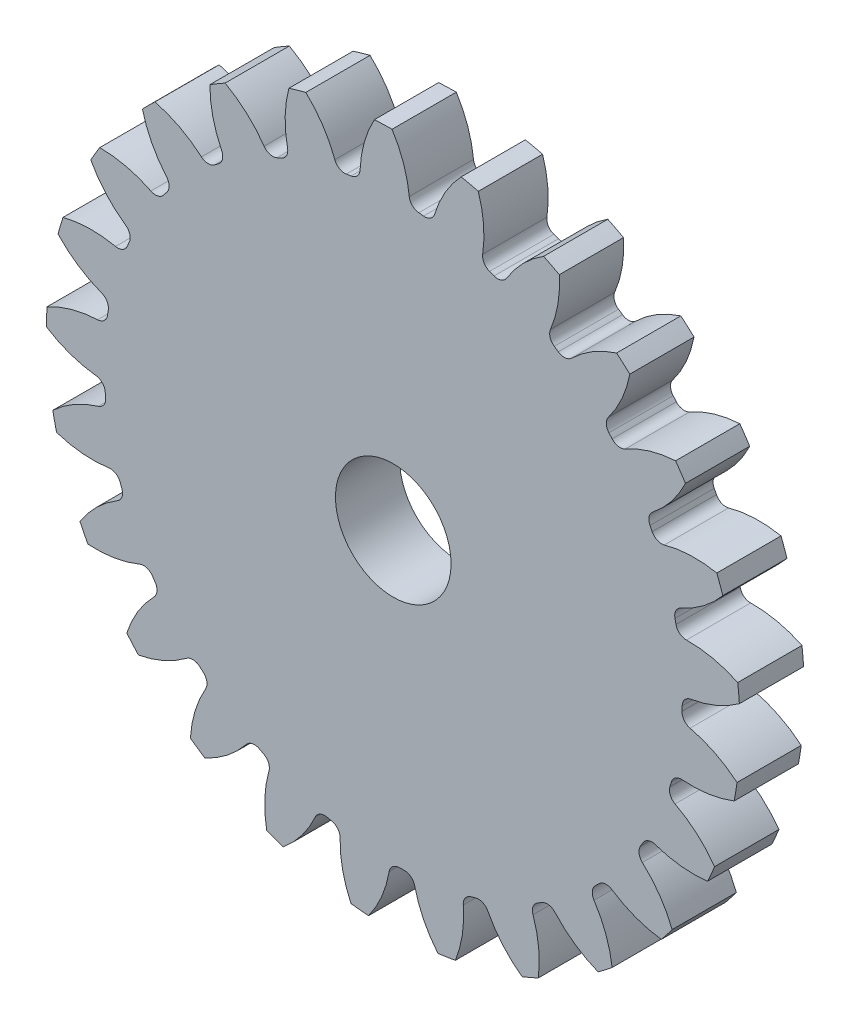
from build123d import *

# Parameters (mm, degrees)
SKETCH3_R         = 685.8
GEARBODY_DEPTH    = 127
TOOTHCUT_DEPTH    = 979.14737131
CIRPATTERN1_COUNT = 25
BOREDIA_R         = 114.3
BORE_DEPTH        = 12700


with BuildPart() as part:
    # Sketch3 → gearBody (new body)
    with BuildSketch(Plane.XY):
        Circle(SKETCH3_R)
    extrude(amount=GEARBODY_DEPTH)

    # Sketch2 → toothCut (cut, through all)
    with BuildSketch(Plane.XY):
        with BuildLine():
            ThreePointArc((570.988912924, -24.164257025), (571.171794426, -19.365723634), (571.314350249, -14.56582299))
            ThreePointArc((571.314350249, -14.56582299), (576.375518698, -1.532558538), (588.573898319, 5.299786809))
            ThreePointArc((588.573898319, 5.299786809), (639.629566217, 20.174828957), (685.8, 46.56117292))
            ThreePointArc((685.8, 46.56117292), (686.98402346, -23.292366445), (681.071354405, -92.905290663))
            ThreePointArc((681.071354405, -92.905290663), (636.794167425, -63.452297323), (586.863274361, -45.153280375))
            ThreePointArc((586.863274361, -45.153280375), (575.155681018, -37.51039699), (570.988912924, -24.164257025))
        make_face()
    toothcut = extrude(amount=TOOTHCUT_DEPTH, mode=Mode.SUBTRACT)

    # CirPattern1: toothCut ×25 about axis
    cirpattern1_axis = Axis((0, 0, 0), (0, 0, 1))
    for i in range(1, CIRPATTERN1_COUNT):
        add(toothcut.rotate(cirpattern1_axis, i * 360 / CIRPATTERN1_COUNT), mode=Mode.SUBTRACT)

    # boreDia → bore (cut, symmetric)
    with BuildSketch(Plane.XY):
        Circle(BOREDIA_R)
    extrude(amount=BORE_DEPTH, both=True, mode=Mode.SUBTRACT)


solid = part.part
